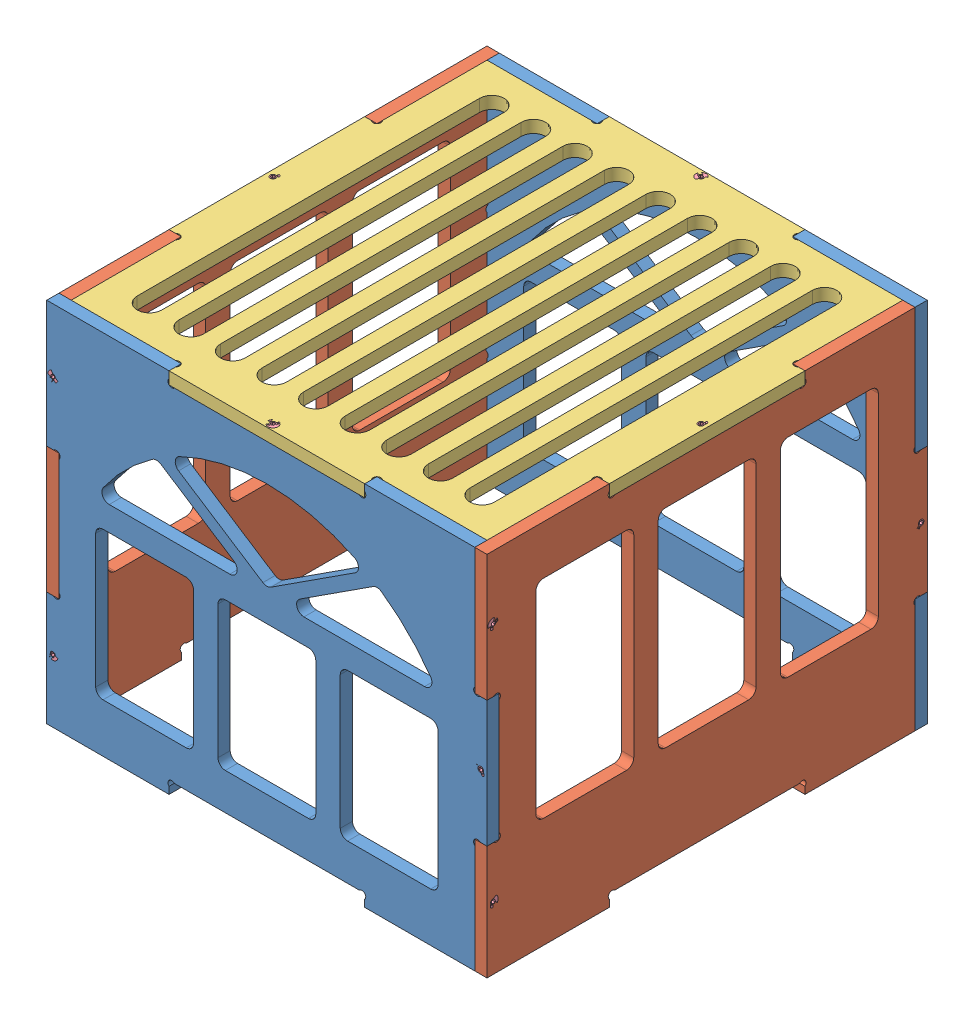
SolidWorks assembly Boîte extérieure.SLDASM, configuration Défaut (file format 5000). Lengths in mm.
Overall size (180.49 150 180).
21 component instances, 4 part files, 44 mates.
Components (placement in the parent):
- exterieur_coté - AV+AR-5: exterieur_coté - AV+AR.SLDPRT [Défaut] at (-121.068 -65.0574 0) size (180 150 5)
- exterieur_coté-2: exterieur_coté.SLDPRT [Défaut] at (-116.068 -65.0574 -175) x (0 0 1) z (-1 0 0) size (180 150 5)
- exterieur_coté-3: exterieur_coté.SLDPRT [Défaut] at (53.932 -65.0574 5) x (0 0 -1) z (1 0 0) size (180 150 5)
- exterieur_coté - AV+AR-4: exterieur_coté - AV+AR.SLDPRT [Défaut] at (58.932 -65.0574 -170) x (-1 0 0) z (0 0 -1) size (180 150 5)
- exterieur_dessus-1: exterieur_dessus.SLDPRT [Défaut] at (-121.068 79.9426 -175) x (1 0 0) z (0 -1 0) size (180 180 5)
- VIS TORCX TF 2.2X13-1: VIS TORCX TF 2.2X13.SLDPRT [Défaut] at (-118.568 54.1093 5) size (4.2 4.2 13)
- VIS TORCX TF 2.2X13-2: VIS TORCX TF 2.2X13.SLDPRT [Défaut] at (-118.568 -44.224 5) size (4.2 4.2 13)
- VIS TORCX TF 2.2X13-3: VIS TORCX TF 2.2X13.SLDPRT [Défaut] at (56.432 2.4426 5) size (4.2 4.2 13)
- VIS TORCX TF 2.2X13-6: VIS TORCX TF 2.2X13.SLDPRT [Défaut] at (56.432 54.1093 -175) x (-0.923728 -0.383049 0) z (0 0 -1) size (4.2 4.2 13)
- VIS TORCX TF 2.2X13-7: VIS TORCX TF 2.2X13.SLDPRT [Défaut] at (56.432 -44.224 -175) x (-0.923728 -0.383049 0) z (0 0 -1) size (4.2 4.2 13)
- VIS TORCX TF 2.2X13-8: VIS TORCX TF 2.2X13.SLDPRT [Défaut] at (-118.568 2.4426 -175) x (-0.923728 -0.383049 0) z (0 0 -1) size (4.2 4.2 13)
- VIS TORCX TF 2.2X13-12: VIS TORCX TF 2.2X13.SLDPRT [Défaut] at (-121.068 2.4426 2.5) x (0 0 1) z (-1 0 0) size (4.2 4.2 13)
- VIS TORCX TF 2.2X13-13: VIS TORCX TF 2.2X13.SLDPRT [Défaut] at (-121.068 -44.224 -172.5) x (0 0 1) z (-1 0 0) size (4.2 4.2 13)
- VIS TORCX TF 2.2X13-14: VIS TORCX TF 2.2X13.SLDPRT [Défaut] at (-121.068 54.1093 -172.5) x (0 0 1) z (-1 0 0) size (4.2 4.2 13)
- VIS TORCX TF 2.2X13-17: VIS TORCX TF 2.2X13.SLDPRT [Défaut] at (58.932 54.1093 2.5) x (0 0 -1) z (1 0 0) size (4.2 4.2 13)
- VIS TORCX TF 2.2X13-18: VIS TORCX TF 2.2X13.SLDPRT [Défaut] at (58.932 2.4426 -172.5) x (0 0 -1) z (1 0 0) size (4.2 4.2 13)
- VIS TORCX TF 2.2X13-19: VIS TORCX TF 2.2X13.SLDPRT [Défaut] at (58.932 -44.224 2.5) x (0 0 -1) z (1 0 0) size (4.2 4.2 13)
- VIS TORCX TF 2.2X13-20: VIS TORCX TF 2.2X13.SLDPRT [Défaut] at (56.432 79.9426 -85) x (1 0 0) z (0 1 0) size (4.2 4.2 13)
- VIS TORCX TF 2.2X13-21: VIS TORCX TF 2.2X13.SLDPRT [Défaut] at (-31.068 79.9426 2.5) x (1 0 0) z (0 1 0) size (4.2 4.2 13)
- VIS TORCX TF 2.2X13-22: VIS TORCX TF 2.2X13.SLDPRT [Défaut] at (-118.568 79.9426 -85) x (1 0 0) z (0 1 0) size (4.2 4.2 13)
- VIS TORCX TF 2.2X13-23: VIS TORCX TF 2.2X13.SLDPRT [Défaut] at (-31.068 79.9426 -172.5) x (1 0 0) z (0 1 0) size (4.2 4.2 13)
Mates (geometry in assembly coordinates):
- Coïncidente1: coincident: plane of exterieur_coté - AV+AR-5 through (53.932 79.9426 0) normal (1 0 0); plane of exterieur_coté-3 through (53.932 -66.118 -46.0607) normal (-1 0 0)
- Coïncidente2: coincident aligned: plane of exterieur_coté - AV+AR-5 through (-70.0073 -66.118 5) normal (0 0 1); plane of exterieur_coté-3 through (58.932 -65.0574 5) normal (0 0 1)
- Coïncidente3: coincident aligned: plane of exterieur_coté - AV+AR-5 through (-121.068 79.9426 5) normal (0 1 0); plane of exterieur_coté-3 through (58.932 79.9426 5) normal (0 1 0)
- Coïncidente4: coincident aligned: plane of exterieur_coté - AV+AR-5 through (-70.0073 -66.118 5) normal (0 0 1); plane of exterieur_coté-2 through (-121.068 -65.0574 5) normal (0 0 1)
- Coïncidente5: coincident aligned: plane of exterieur_coté - AV+AR-5 through (-121.068 79.9426 5) normal (0 1 0); plane of exterieur_coté-2 through (-121.068 79.9426 -175) normal (0 1 0)
- Coïncidente6: coincident aligned: plane of exterieur_coté - AV+AR-5 through (-121.068 -65.0574 5) normal (-1 0 0); plane of exterieur_coté-2 through (-121.068 -66.118 -123.9393) normal (-1 0 0)
- Coïncidente7: coincident aligned: plane of exterieur_coté-2 through (-121.068 -66.118 -123.9393) normal (-1 0 0); plane of exterieur_coté - AV+AR-4 through (-121.068 -65.0574 -175) normal (-1 0 0)
- Coïncidente8: coincident aligned: plane of exterieur_coté-2 through (-121.068 79.9426 -175) normal (0 1 0); plane of exterieur_coté - AV+AR-4 through (58.932 79.9426 -175) normal (0 1 0)
- Coïncidente9: coincident aligned: plane of exterieur_coté-2 through (-121.068 -65.0574 -175) normal (0 0 -1); plane of exterieur_coté - AV+AR-4 through (7.8714 -66.118 -175) normal (0 0 -1)
- Coïncidente10: coincident anti-aligned: plane of exterieur_coté - AV+AR-4 through (8.932 74.9426 -170) normal (0 1 0); plane of exterieur_dessus-1 through (-121.068 74.9426 -175) normal (0 -1 0)
- Coïncidente11: coincident aligned: plane of exterieur_coté-2 through (-121.068 -66.118 -123.9393) normal (-1 0 0); plane of exterieur_dessus-1 through (-121.068 74.9426 -175) normal (-1 0 0)
- Coïncidente12: coincident aligned: plane of exterieur_coté - AV+AR-4 through (7.8714 -66.118 -175) normal (0 0 -1); plane of exterieur_dessus-1 through (-121.068 74.9426 -175) normal (0 0 -1)
- Coïncidente13: coincident aligned: axis of exterieur_coté - AV+AR-5 through (-118.568 54.1093 0) axis (0 0 1); axis of VIS TORCX TF 2.2X13-1 through (-118.568 54.1093 -6.0947) axis (0 0 1)
- Coïncidente14: coincident aligned: plane of exterieur_coté - AV+AR-5 through (-70.0073 -66.118 5) normal (0 0 1); plane of VIS TORCX TF 2.2X13-1 through (-118.568 56.2093 5) normal (0 0 1)
- Coïncidente15: coincident aligned: axis of exterieur_coté - AV+AR-5 through (-118.568 -44.224 0) axis (0 0 1); axis of VIS TORCX TF 2.2X13-2 through (-118.568 -44.224 -6.0947) axis (0 0 1)
- Coïncidente16: coincident aligned: plane of exterieur_coté - AV+AR-5 through (-70.0073 -66.118 5) normal (0 0 1); plane of VIS TORCX TF 2.2X13-2 through (-118.568 -42.124 5) normal (0 0 1)
- Coïncidente17: coincident aligned: axis of exterieur_coté - AV+AR-5 through (56.432 2.4426 0) axis (0 0 1); axis of VIS TORCX TF 2.2X13-3 through (56.432 2.4426 -6.0947) axis (0 0 1)
- Coïncidente18: coincident aligned: plane of exterieur_coté - AV+AR-5 through (-70.0073 -66.118 5) normal (0 0 1); plane of VIS TORCX TF 2.2X13-3 through (56.432 4.5426 5) normal (0 0 1)
- Coïncidente19: coincident aligned: axis of exterieur_coté - AV+AR-4 through (-118.568 2.4426 -170) axis (0 0 -1); axis of VIS TORCX TF 2.2X13-8 through (-118.568 2.4426 -163.9053) axis (0 0 -1)
- Coïncidente20: coincident aligned: plane of exterieur_coté - AV+AR-4 through (7.8714 -66.118 -175) normal (0 0 -1); plane of VIS TORCX TF 2.2X13-8 through (-119.3724 4.3825 -175) normal (0 0 -1)
- Coïncidente21: coincident aligned: axis of exterieur_coté - AV+AR-4 through (56.432 54.1093 -170) axis (0 0 -1); axis of VIS TORCX TF 2.2X13-6 through (56.432 54.1093 -163.9053) axis (0 0 -1)
- Coïncidente22: coincident aligned: plane of exterieur_coté - AV+AR-4 through (7.8714 -66.118 -175) normal (0 0 -1); plane of VIS TORCX TF 2.2X13-6 through (55.6276 56.0491 -175) normal (0 0 -1)
- Coïncidente23: coincident aligned: axis of exterieur_coté - AV+AR-4 through (56.432 -44.224 -170) axis (0 0 -1); axis of VIS TORCX TF 2.2X13-7 through (56.432 -44.224 -163.9053) axis (0 0 -1)
- Coïncidente24: coincident aligned: plane of exterieur_coté - AV+AR-4 through (7.8714 -66.118 -175) normal (0 0 -1); plane of VIS TORCX TF 2.2X13-7 through (55.6276 -42.2842 -175) normal (0 0 -1)
- Coïncidente25: coincident aligned: axis of exterieur_coté-3 through (53.932 2.4426 -172.5) axis (1 0 0); axis of VIS TORCX TF 2.2X13-18 through (47.8373 2.4426 -172.5) axis (1 0 0)
- Coïncidente26: coincident aligned: plane of exterieur_coté-3 through (58.932 -66.118 -46.0607) normal (1 0 0); plane of VIS TORCX TF 2.2X13-18 through (58.932 4.5426 -172.5) normal (1 0 0)
- Coïncidente27: coincident aligned: axis of exterieur_coté-3 through (53.932 -44.224 2.5) axis (1 0 0); axis of VIS TORCX TF 2.2X13-19 through (47.8373 -44.224 2.5) axis (1 0 0)
- Coïncidente28: coincident aligned: plane of exterieur_coté-3 through (58.932 -66.118 -46.0607) normal (1 0 0); plane of VIS TORCX TF 2.2X13-19 through (58.932 -42.124 2.5) normal (1 0 0)
- Coïncidente29: coincident aligned: axis of exterieur_coté-3 through (53.932 54.1093 2.5) axis (1 0 0); axis of VIS TORCX TF 2.2X13-17 through (47.8373 54.1093 2.5) axis (1 0 0)
- Coïncidente30: coincident aligned: plane of exterieur_coté-3 through (58.932 -66.118 -46.0607) normal (1 0 0); plane of VIS TORCX TF 2.2X13-17 through (58.932 56.2093 2.5) normal (1 0 0)
- Coïncidente31: coincident aligned: axis of exterieur_coté-2 through (-116.068 2.4426 2.5) axis (-1 0 0); axis of VIS TORCX TF 2.2X13-12 through (-109.9732 2.4426 2.5) axis (-1 0 0)
- Coïncidente32: coincident aligned: plane of exterieur_coté-2 through (-121.068 -66.118 -123.9393) normal (-1 0 0); plane of VIS TORCX TF 2.2X13-12 through (-121.068 4.5426 2.5) normal (-1 0 0)
- Coïncidente33: coincident aligned: axis of exterieur_coté-2 through (-116.068 -44.224 -172.5) axis (-1 0 0); axis of VIS TORCX TF 2.2X13-13 through (-109.9732 -44.224 -172.5) axis (-1 0 0)
- Coïncidente34: coincident aligned: plane of exterieur_coté-2 through (-121.068 -66.118 -123.9393) normal (-1 0 0); plane of VIS TORCX TF 2.2X13-13 through (-121.068 -42.124 -172.5) normal (-1 0 0)
- Coïncidente35: coincident aligned: axis of exterieur_coté-2 through (-116.068 54.1093 -172.5) axis (-1 0 0); axis of VIS TORCX TF 2.2X13-14 through (-109.9732 54.1093 -172.5) axis (-1 0 0)
- Coïncidente36: coincident aligned: plane of exterieur_coté-2 through (-121.068 -66.118 -123.9393) normal (-1 0 0); plane of VIS TORCX TF 2.2X13-14 through (-121.068 56.2093 -172.5) normal (-1 0 0)
- Coïncidente37: coincident aligned: axis of exterieur_dessus-1 through (-31.068 74.9426 -172.5) axis (0 1 0); axis of VIS TORCX TF 2.2X13-23 through (-31.068 68.8479 -172.5) axis (0 1 0)
- Coïncidente38: coincident aligned: plane of exterieur_dessus-1 through (-121.068 79.9426 -175) normal (0 1 0); plane of VIS TORCX TF 2.2X13-23 through (-31.068 79.9426 -174.6) normal (0 1 0)
- Coïncidente39: coincident aligned: axis of exterieur_dessus-1 through (-118.568 74.9426 -85) axis (0 1 0); axis of VIS TORCX TF 2.2X13-22 through (-118.568 68.8479 -85) axis (0 1 0)
- Coïncidente40: coincident aligned: plane of exterieur_dessus-1 through (-121.068 79.9426 -175) normal (0 1 0); plane of VIS TORCX TF 2.2X13-22 through (-118.568 79.9426 -87.1) normal (0 1 0)
- Coïncidente41: coincident aligned: axis of exterieur_dessus-1 through (56.432 74.9426 -85) axis (0 1 0); axis of VIS TORCX TF 2.2X13-20 through (56.432 68.8479 -85) axis (0 1 0)
- Coïncidente42: coincident aligned: plane of exterieur_dessus-1 through (-121.068 79.9426 -175) normal (0 1 0); plane of VIS TORCX TF 2.2X13-20 through (56.432 79.9426 -87.1) normal (0 1 0)
- Coïncidente43: coincident aligned: axis of exterieur_dessus-1 through (-31.068 74.9426 2.5) axis (0 1 0); axis of VIS TORCX TF 2.2X13-21 through (-31.068 68.8479 2.5) axis (0 1 0)
- Coïncidente44: coincident aligned: plane of exterieur_dessus-1 through (-121.068 79.9426 -175) normal (0 1 0); plane of VIS TORCX TF 2.2X13-21 through (-31.068 79.9426 0.4) normal (0 1 0)
